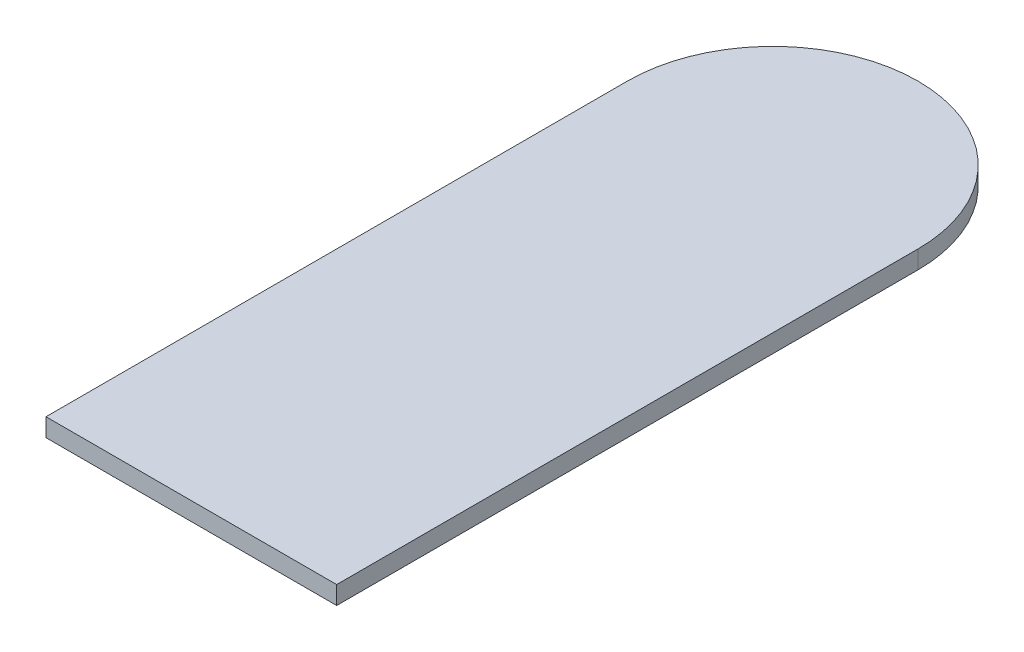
from build123d import *

# Parameters (mm, degrees)
BOSS_EXTRUDE1_DEPTH = 3.175


with BuildPart() as part:
    # Sketch1 → Boss-Extrude1 (new body)
    with BuildSketch(Plane(origin=(0, 0, 0), x_dir=(1, 0, 0), z_dir=(0, 1, 0))):
        with BuildLine():
            Line((-25.4, -50.8), (25.4, -50.8))
            Line((25.4, -50.8), (25.4, 50.8))
            ThreePointArc((25.4, 50.8), (0, 76.2), (-25.4, 50.8))
            Line((-25.4, 50.8), (-25.4, -50.8))
        make_face()
    extrude(amount=BOSS_EXTRUDE1_DEPTH)


solid = part.part
